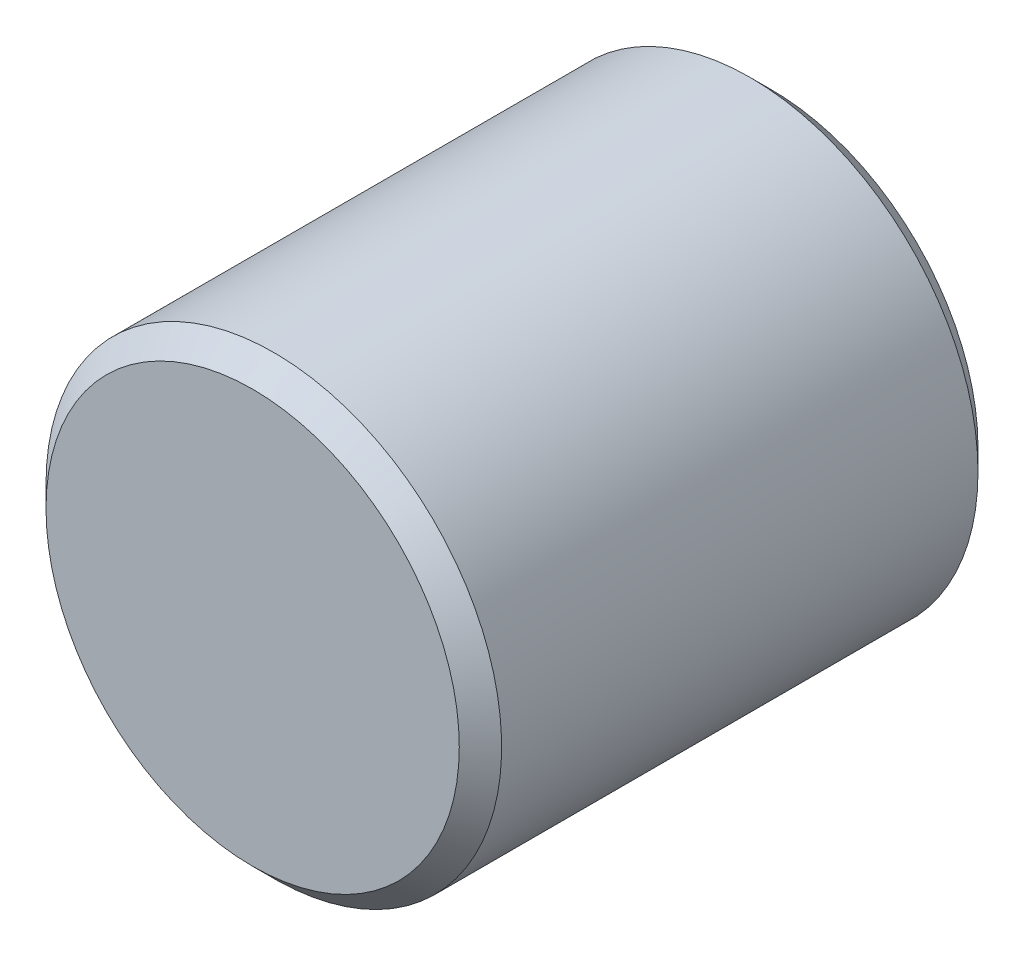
from build123d import *

# Parameters (mm, degrees)
SKETCH1_R           = 6.8326
BOSS_EXTRUDE1_DEPTH = 15.5575
CHAMFER1_SIZE       = 0.635


with BuildPart() as part:
    # Sketch1 → Boss-Extrude1 (new body)
    with BuildSketch(Plane.XY):
        with Locations(Location((0, 0, 0), (0, 0, 180))):
            Circle(SKETCH1_R)
    extrude(amount=BOSS_EXTRUDE1_DEPTH)

    # Chamfer1
    chamfer1_edges = [part.edges().sort_by_distance(p)[0] for p in [
        (6.8326, 0, 0),
        (6.8326, 0, 15.5575),
    ]]
    chamfer(chamfer1_edges, length=CHAMFER1_SIZE)


solid = part.part
